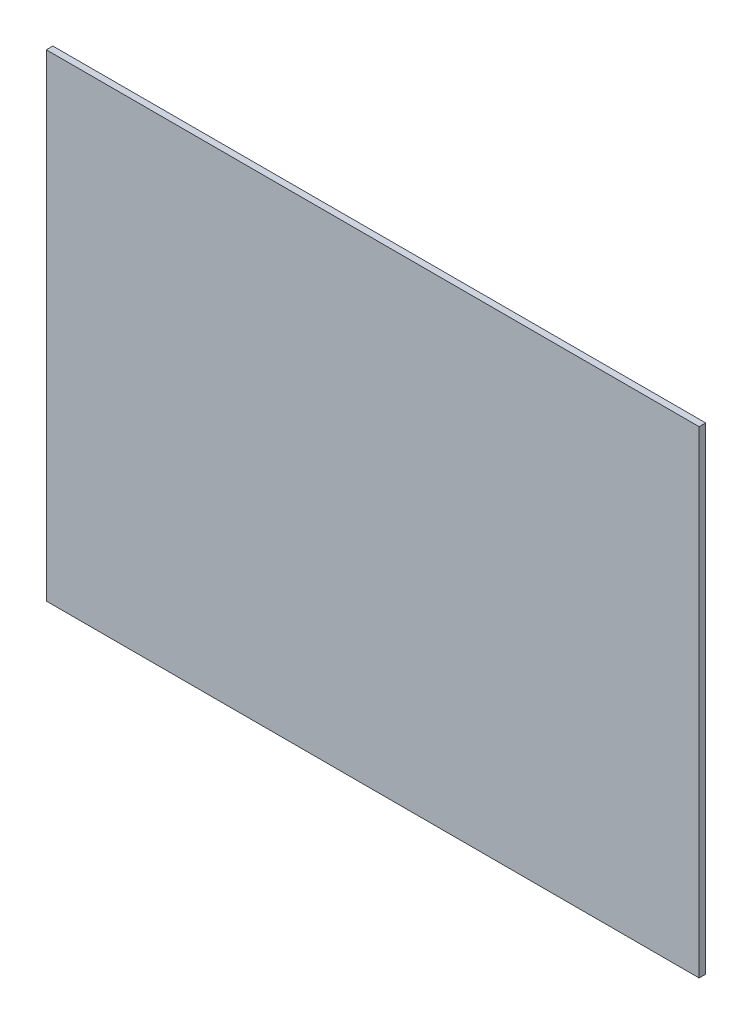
from build123d import *

# Parameters (mm, degrees)
CROQUIS1_W              = 998.2
CROQUIS1_H              = 730
SALIENTE_EXTRUIR1_DEPTH = 10


with BuildPart() as part:
    # Croquis1 → Saliente-Extruir1 (new body)
    with BuildSketch(Plane.XY):
        with Locations((75.864049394, -20.044827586)):
            Rectangle(CROQUIS1_W, CROQUIS1_H)
    extrude(amount=SALIENTE_EXTRUIR1_DEPTH)


solid = part.part
